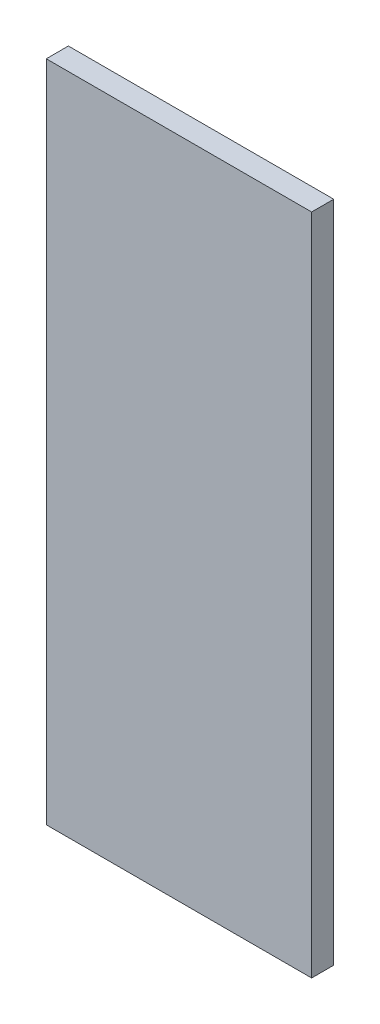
from build123d import *

# Parameters (mm, degrees)
SKETCH1_W  = 12
SKETCH1_H  = 30
TAPE_DEPTH = 1


with BuildPart() as part:
    # Sketch1 → Tape (new body)
    with BuildSketch(Plane.XY):
        Rectangle(SKETCH1_W, SKETCH1_H)
    extrude(amount=TAPE_DEPTH)


solid = part.part
